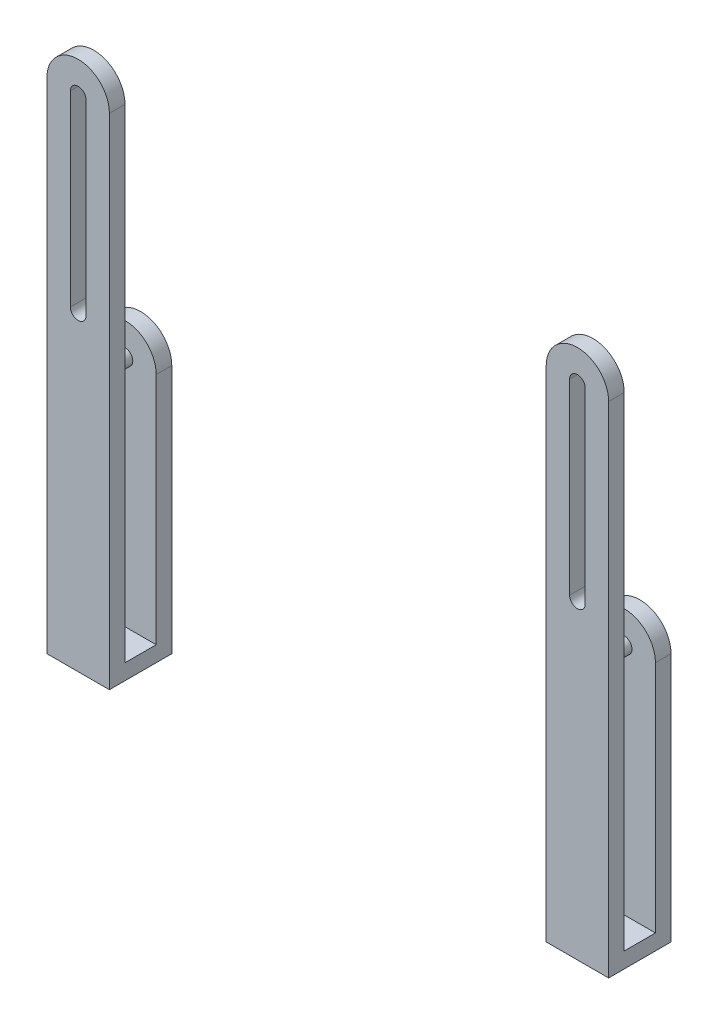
from build123d import *

# Parameters (mm, degrees)
EXTRUDE1_DEPTH     = 12.7
SKETCH2_W          = 50.8
SKETCH2_H          = 12.7
EXTRUDE2_DEPTH     = 25.4
EXTRUDE3_DEPTH     = 12.7
CUT_EXTRUDE2_REACH = 437.519
EXTRUDE4_START     = -12.7
SKETCH4_R          = 6.35
EXTRUDE4_DEPTH     = 19.05
LPATTERN1_COUNT    = 2
LPATTERN1_PITCH    = 406.4


with BuildPart() as part:
    # Sketch1 → Extrude1 (new body)
    with BuildSketch(Plane.XY):
        with BuildLine():
            Line((-25.4, 0), (25.4, 0))
            Line((25.4, 0), (25.4, 203.2))
            ThreePointArc((25.4, 203.2), (0, 228.6), (-25.4, 203.2))
            Line((-25.4, 203.2), (-25.4, 0))
        make_face()
    extrude(amount=EXTRUDE1_DEPTH)

    # Sketch2 → Extrude2 (add)
    with BuildSketch(Plane.XY.offset(12.7)):
        with Locations((0, 6.35)):
            Rectangle(SKETCH2_W, SKETCH2_H)
    extrude(amount=EXTRUDE2_DEPTH)

    # Sketch3 → Extrude3 (add)
    with BuildSketch(Plane.XY.offset(38.1)):
        with BuildLine():
            Line((-25.4, 0), (-25.4, 406.4))
            ThreePointArc((-25.4, 406.4), (0, 431.8), (25.4, 406.4))
            Line((25.4, 406.4), (25.4, 0))
            Line((25.4, 0), (-25.4, 0))
        make_face()
    extrude(amount=EXTRUDE3_DEPTH)

    # Sketch5 → Cut-Extrude2 (cut, up to next)
    with BuildSketch(Plane.XY.offset(50.8), mode=Mode.PRIVATE) as cut_extrude2_sk1:
        with BuildLine():
            Line((-6.35, 406.4), (-6.35, 254))
            ThreePointArc((-6.35, 254), (0, 247.65), (6.35, 254))
            Line((6.35, 254), (6.35, 406.4))
            ThreePointArc((6.35, 406.4), (0, 412.75), (-6.35, 406.4))
        make_face()
    cut_extrude2_tool1 = extrude(cut_extrude2_sk1.sketch, amount=-CUT_EXTRUDE2_REACH, mode=Mode.PRIVATE) & part.part
    add(cut_extrude2_tool1.solids().sort_by_distance((0, 330.2, 50.8))[0], mode=Mode.SUBTRACT)

    # Sketch4 → Extrude4 (add)
    with BuildSketch(Plane(origin=(0, 0, 0), x_dir=(-1, 0, 0), z_dir=(0, 0, -1)).offset(EXTRUDE4_START)):
        with Locations((0, 203.2)):
            Circle(SKETCH4_R)
    extrude(amount=-EXTRUDE4_DEPTH)


with BuildPart() as lpattern1_1:
    # LPattern1: pattern copy
    add(part.part.moved(Location(Vector(-1, 0, 0) * (1 * LPATTERN1_PITCH))))


solid = Compound([part.part, lpattern1_1.part])
